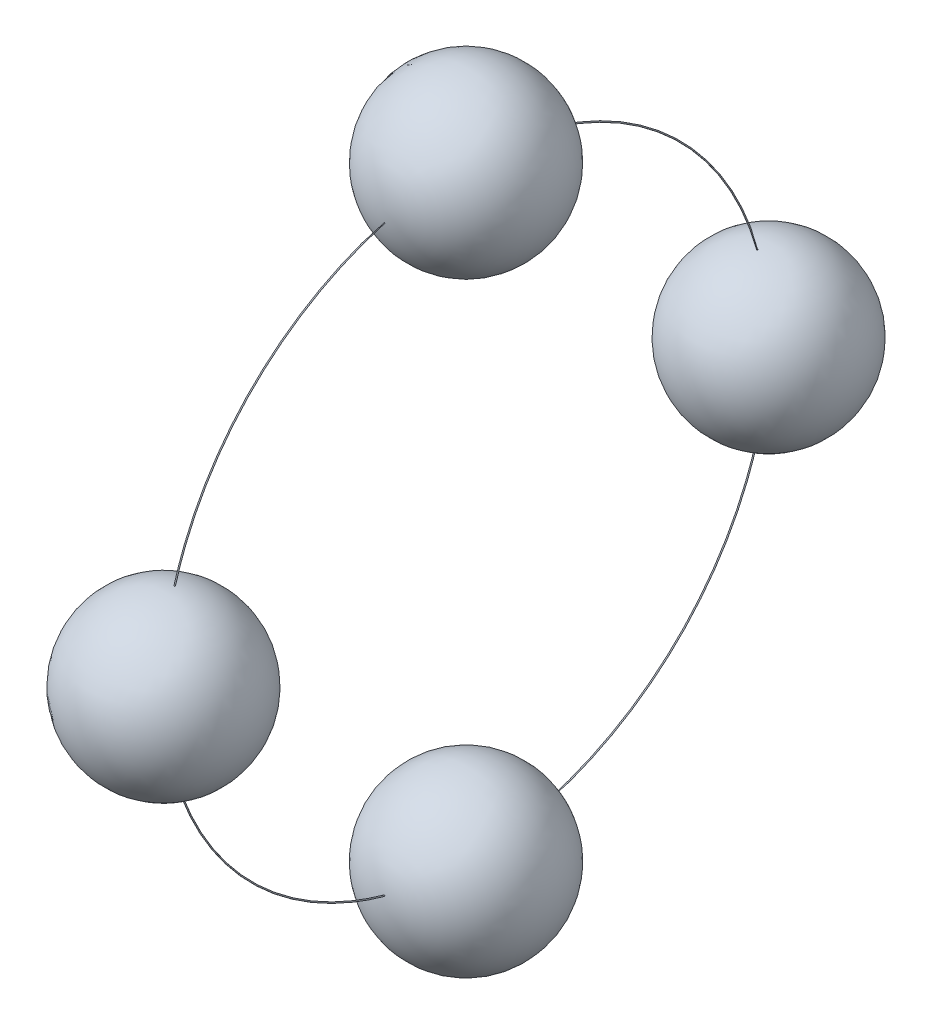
ISO-10303-21;
HEADER;
FILE_DESCRIPTION(('STEP AP214'),'2;1');
FILE_NAME('part.step','',(''),(''),'','','');
FILE_SCHEMA(('AUTOMOTIVE_DESIGN { 1 0 10303 214 1 1 1 1 }'));
ENDSEC;
DATA;
#1=APPLICATION_CONTEXT('core data for automotive mechanical design processes');
#2=APPLICATION_PROTOCOL_DEFINITION('international standard','automotive_design',2000,#1);
#3=PRODUCT_CONTEXT('',#1,'mechanical');
#4=PRODUCT('Part','Part','',(#3));
#5=PRODUCT_RELATED_PRODUCT_CATEGORY('part','',(#4));
#6=PRODUCT_DEFINITION_FORMATION('','',#4);
#7=PRODUCT_DEFINITION_CONTEXT('part definition',#1,'design');
#8=PRODUCT_DEFINITION('design','',#6,#7);
#9=PRODUCT_DEFINITION_SHAPE('','',#8);
#10=(LENGTH_UNIT() NAMED_UNIT(*) SI_UNIT(.MILLI.,.METRE.));
#11=(NAMED_UNIT(*) PLANE_ANGLE_UNIT() SI_UNIT($,.RADIAN.));
#12=(NAMED_UNIT(*) SI_UNIT($,.STERADIAN.) SOLID_ANGLE_UNIT());
#13=UNCERTAINTY_MEASURE_WITH_UNIT(LENGTH_MEASURE(1.E-05),#10,'distance_accuracy_value','');
#14=(GEOMETRIC_REPRESENTATION_CONTEXT(3) GLOBAL_UNCERTAINTY_ASSIGNED_CONTEXT((#13)) GLOBAL_UNIT_ASSIGNED_CONTEXT((#10,
#11,#12)) REPRESENTATION_CONTEXT('',''));
#15=CARTESIAN_POINT('',(0.,0.,0.));
#16=DIRECTION('',(0.,0.,1.));
#17=DIRECTION('',(1.,0.,0.));
#18=AXIS2_PLACEMENT_3D('',#15,#16,#17);
#19=CARTESIAN_POINT('',(5.,0.,0.));
#20=DIRECTION('',(1.,0.,0.));
#21=DIRECTION('',(0.,-1.,0.));
#22=AXIS2_PLACEMENT_3D('',#19,#20,#21);
#23=TOROIDAL_SURFACE('',#22,11.,0.02);
#24=CARTESIAN_POINT('',(4.98866699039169,-2.97417919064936,-10.6074064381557));
#25=CARTESIAN_POINT('',(4.98773797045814,-2.97409130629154,-10.6067674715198));
#26=CARTESIAN_POINT('',(4.98686309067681,-2.97399258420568,-10.606049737));
#27=CARTESIAN_POINT('',(4.98524699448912,-2.97377638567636,-10.6044780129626));
#28=CARTESIAN_POINT('',(4.98450595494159,-2.97365888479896,-10.6036238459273));
#29=CARTESIAN_POINT('',(4.98317937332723,-2.9734087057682,-10.6018053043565));
#30=CARTESIAN_POINT('',(4.98259369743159,-2.97327604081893,-10.6008410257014));
#31=CARTESIAN_POINT('',(4.98159303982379,-2.9729992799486,-10.5988295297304));
#32=CARTESIAN_POINT('',(4.98117801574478,-2.97285518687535,-10.5977823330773));
#33=CARTESIAN_POINT('',(4.98052730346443,-2.97255861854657,-10.5956271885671));
#34=CARTESIAN_POINT('',(4.98029279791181,-2.97240609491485,-10.5945188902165));
#35=CARTESIAN_POINT('',(4.98001383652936,-2.97209781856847,-10.5922790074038));
#36=CARTESIAN_POINT('',(4.97996939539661,-2.97194206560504,-10.5911474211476));
#37=CARTESIAN_POINT('',(4.98007204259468,-2.97163089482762,-10.5888868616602));
#38=CARTESIAN_POINT('',(4.98022013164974,-2.97147548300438,-10.5877579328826));
#39=CARTESIAN_POINT('',(4.98070561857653,-2.97117023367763,-10.5855407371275));
#40=CARTESIAN_POINT('',(4.98104301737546,-2.97102039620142,-10.5844524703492));
#41=CARTESIAN_POINT('',(4.98189776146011,-2.97073067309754,-10.5823483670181));
#42=CARTESIAN_POINT('',(4.98241500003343,-2.97059078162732,-10.581332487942));
#43=CARTESIAN_POINT('',(4.98361532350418,-2.97032491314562,-10.5794018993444));
#44=CARTESIAN_POINT('',(4.9842984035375,-2.9701989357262,-10.5784871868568));
#45=CARTESIAN_POINT('',(4.9858066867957,-2.96996533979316,-10.5767911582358));
#46=CARTESIAN_POINT('',(4.98663098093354,-2.96985761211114,-10.5760090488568));
#47=CARTESIAN_POINT('',(4.9884014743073,-2.96966277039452,-10.5745945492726));
#48=CARTESIAN_POINT('',(4.98934766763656,-2.96957565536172,-10.5739621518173));
#49=CARTESIAN_POINT('',(4.99132587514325,-2.9694253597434,-10.5728711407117));
#50=CARTESIAN_POINT('',(4.99235703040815,-2.96936196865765,-10.5724109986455));
#51=CARTESIAN_POINT('',(4.9944830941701,-2.96925992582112,-10.5716703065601));
#52=CARTESIAN_POINT('',(4.99557799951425,-2.96922127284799,-10.5713897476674));
#53=CARTESIAN_POINT('',(4.99779116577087,-2.96917008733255,-10.571018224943));
#54=CARTESIAN_POINT('',(4.9989091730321,-2.9691573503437,-10.5709257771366));
#55=CARTESIAN_POINT('',(5.00114491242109,-2.9691577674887,-10.5709288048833));
#56=CARTESIAN_POINT('',(5.00226264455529,-2.96917092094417,-10.5710242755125));
#57=CARTESIAN_POINT('',(5.00446233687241,-2.96922263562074,-10.5713996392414));
#58=CARTESIAN_POINT('',(5.00554440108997,-2.9692611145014,-10.5716789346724));
#59=CARTESIAN_POINT('',(5.00764603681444,-2.96936224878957,-10.572413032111));
#60=CARTESIAN_POINT('',(5.00866560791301,-2.96942490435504,-10.5728678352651));
#61=CARTESIAN_POINT('',(5.01061660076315,-2.96957275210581,-10.5739410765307));
#62=CARTESIAN_POINT('',(5.01154776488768,-2.96965800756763,-10.5745599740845));
#63=CARTESIAN_POINT('',(5.01329300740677,-2.96984848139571,-10.5759427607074));
#64=CARTESIAN_POINT('',(5.0141070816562,-2.9699537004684,-10.5767066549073));
#65=CARTESIAN_POINT('',(5.01560177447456,-2.97018195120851,-10.5783638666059));
#66=CARTESIAN_POINT('',(5.01628132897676,-2.9703051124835,-10.5792581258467));
#67=CARTESIAN_POINT('',(5.01748085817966,-2.97056511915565,-10.5811461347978));
#68=CARTESIAN_POINT('',(5.01800082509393,-2.97070196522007,-10.5821398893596));
#69=CARTESIAN_POINT('',(5.01887132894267,-2.9709867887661,-10.5842083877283));
#70=CARTESIAN_POINT('',(5.01922028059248,-2.97113485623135,-10.58528378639));
#71=CARTESIAN_POINT('',(5.01973234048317,-2.97143683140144,-10.5874771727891));
#72=CARTESIAN_POINT('',(5.01989544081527,-2.97159073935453,-10.5885951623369));
#73=CARTESIAN_POINT('',(5.02003192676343,-2.97190111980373,-10.5908499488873));
#74=CARTESIAN_POINT('',(5.02000404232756,-2.97205760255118,-10.5919868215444));
#75=CARTESIAN_POINT('',(5.01975629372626,-2.9723676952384,-10.5942398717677));
#76=CARTESIAN_POINT('',(5.01953642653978,-2.97252130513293,-10.5953560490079));
#77=CARTESIAN_POINT('',(5.01891018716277,-2.97282148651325,-10.597537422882));
#78=CARTESIAN_POINT('',(5.01850357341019,-2.97296804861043,-10.5986025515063));
#79=CARTESIAN_POINT('',(5.0175147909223,-2.97324970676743,-10.6006496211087));
#80=CARTESIAN_POINT('',(5.0169326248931,-2.97338480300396,-10.6016315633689));
#81=CARTESIAN_POINT('',(5.0156118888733,-2.97363899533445,-10.6034792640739));
#82=CARTESIAN_POINT('',(5.01487406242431,-2.97375816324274,-10.6043455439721));
#83=CARTESIAN_POINT('',(5.01326092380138,-2.97397773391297,-10.6059417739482));
#84=CARTESIAN_POINT('',(5.01238561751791,-2.97407813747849,-10.606671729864));
#85=CARTESIAN_POINT('',(5.01053036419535,-2.9742564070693,-10.6079678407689));
#86=CARTESIAN_POINT('',(5.0095513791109,-2.97433445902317,-10.608535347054));
#87=CARTESIAN_POINT('',(5.00751053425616,-2.97446682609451,-10.6094977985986));
#88=CARTESIAN_POINT('',(5.00644868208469,-2.97452114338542,-10.6098927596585));
#89=CARTESIAN_POINT('',(5.00428227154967,-2.974604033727,-10.6104954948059));
#90=CARTESIAN_POINT('',(5.00317817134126,-2.9746328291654,-10.6107048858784));
#91=CARTESIAN_POINT('',(5.0009498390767,-2.97466462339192,-10.6109360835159));
#92=CARTESIAN_POINT('',(4.99982560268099,-2.97466761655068,-10.6109578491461));
#93=CARTESIAN_POINT('',(4.99759467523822,-2.97464775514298,-10.6108134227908));
#94=CARTESIAN_POINT('',(4.99648792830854,-2.97462501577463,-10.6106480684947));
#95=CARTESIAN_POINT('',(4.99431912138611,-2.97455456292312,-10.6101357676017));
#96=CARTESIAN_POINT('',(4.99325700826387,-2.97450688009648,-10.6097890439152));
#97=CARTESIAN_POINT('',(4.99160640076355,-2.97441121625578,-10.6090934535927));
#98=CARTESIAN_POINT('',(4.9909944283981,-2.97437057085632,-10.608797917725));
#99=CARTESIAN_POINT('',(4.98980410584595,-2.97428098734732,-10.6081465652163));
#100=CARTESIAN_POINT('',(4.98922575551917,-2.97423204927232,-10.6077907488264));
#101=CARTESIAN_POINT('',(4.98866699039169,-2.97417919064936,-10.6074064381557));
#102=B_SPLINE_CURVE_WITH_KNOTS('',3,(#24,#25,#26,#27,#28,#29,#30,#31,#32,#33,#34,#35,#36,#37,
#38,#39,#40,#41,#42,#43,#44,#45,#46,#47,#48,#49,#50,#51,#52,#53,#54,#55,#56,#57,#58,#59,#60,#61,
#62,#63,#64,#65,#66,#67,#68,#69,#70,#71,#72,#73,#74,#75,#76,#77,#78,#79,#80,#81,#82,#83,#84,#85,
#86,#87,#88,#89,#90,#91,#92,#93,#94,#95,#96,#97,#98,#99,#100,#101),.UNSPECIFIED.,.T.,.F.,(4,2,2,
2,2,2,2,2,2,2,2,2,2,2,2,2,2,2,2,2,2,2,2,2,2,2,2,2,2,2,2,2,2,2,2,2,2,2,4),(0.,
0.00339038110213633,0.00678521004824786,0.0101771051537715,0.0135681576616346,
0.0169812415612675,0.0203945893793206,0.0238257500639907,0.0272569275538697,0.0306860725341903,
0.0341151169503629,0.037522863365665,0.0409304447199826,0.0443070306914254,0.04768344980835,
0.0510331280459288,0.0543827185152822,0.0577214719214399,0.0610602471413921,0.064408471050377,
0.0677568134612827,0.0711306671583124,0.0745046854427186,0.0779094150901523,0.0813142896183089,
0.0847418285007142,0.0881694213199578,0.091601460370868,0.0950334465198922,0.0984493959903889,
0.101865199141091,0.105251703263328,0.108637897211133,0.111994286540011,0.115351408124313,
0.118693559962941,0.122031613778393,0.124070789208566,0.126109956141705),.UNSPECIFIED.);
#103=CARTESIAN_POINT('',(4.98866699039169,-2.97417919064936,-10.6074064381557));
#104=VERTEX_POINT('',#103);
#105=EDGE_CURVE('E10',#104,#104,#102,.T.);
#106=ORIENTED_EDGE('',*,*,#105,.F.);
#107=EDGE_LOOP('',(#106));
#108=FACE_BOUND('',#107,.T.);
#109=CARTESIAN_POINT('',(4.98866699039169,-10.6074064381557,-2.97417919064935));
#110=CARTESIAN_POINT('',(4.98958468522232,-10.6080374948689,-2.97426598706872));
#111=CARTESIAN_POINT('',(4.99055652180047,-10.6085926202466,-2.97434233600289));
#112=CARTESIAN_POINT('',(4.99258117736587,-10.6095339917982,-2.97447180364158));
#113=CARTESIAN_POINT('',(4.99363408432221,-10.6099200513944,-2.97452489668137));
#114=CARTESIAN_POINT('',(4.99579032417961,-10.6105111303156,-2.97460618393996));
#115=CARTESIAN_POINT('',(4.99689364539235,-10.6107161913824,-2.9746343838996));
#116=CARTESIAN_POINT('',(4.99911911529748,-10.6109391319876,-2.97466504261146));
#117=CARTESIAN_POINT('',(5.00024125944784,-10.61095705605,-2.97466750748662));
#118=CARTESIAN_POINT('',(5.00246892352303,-10.6108055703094,-2.97464667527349));
#119=CARTESIAN_POINT('',(5.00357448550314,-10.6106367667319,-2.97462346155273));
#120=CARTESIAN_POINT('',(5.00574137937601,-10.6101178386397,-2.97455209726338));
#121=CARTESIAN_POINT('',(5.00680270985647,-10.6097677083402,-2.9745039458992));
#122=CARTESIAN_POINT('',(5.0088522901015,-10.6088960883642,-2.97438407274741));
#123=CARTESIAN_POINT('',(5.009840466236,-10.6083744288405,-2.97431232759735));
#124=CARTESIAN_POINT('',(5.01171513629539,-10.6071751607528,-2.97414738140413));
#125=CARTESIAN_POINT('',(5.01260162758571,-10.6064975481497,-2.97405417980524));
#126=CARTESIAN_POINT('',(5.01425401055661,-10.6050011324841,-2.97384834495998));
#127=CARTESIAN_POINT('',(5.01501909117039,-10.6041814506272,-2.97373559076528));
#128=CARTESIAN_POINT('',(5.01640098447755,-10.6024274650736,-2.97349429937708));
#129=CARTESIAN_POINT('',(5.01701779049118,-10.6014931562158,-2.97336576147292));
#130=CARTESIAN_POINT('',(5.01809153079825,-10.599527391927,-2.97309530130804));
#131=CARTESIAN_POINT('',(5.01854696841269,-10.5984951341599,-2.97295326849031));
#132=CARTESIAN_POINT('',(5.01927798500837,-10.596369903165,-2.97266082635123));
#133=CARTESIAN_POINT('',(5.01955355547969,-10.5952769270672,-2.97251041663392));
#134=CARTESIAN_POINT('',(5.01991897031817,-10.5930521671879,-2.97220423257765));
#135=CARTESIAN_POINT('',(5.02000735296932,-10.5919201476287,-2.9720484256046));
#136=CARTESIAN_POINT('',(5.01999168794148,-10.5896574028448,-2.97173696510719));
#137=CARTESIAN_POINT('',(5.01988763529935,-10.5885266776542,-2.9715813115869));
#138=CARTESIAN_POINT('',(5.01948923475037,-10.5862949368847,-2.97127407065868));
#139=CARTESIAN_POINT('',(5.01919429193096,-10.5851940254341,-2.97112249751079));
#140=CARTESIAN_POINT('',(5.01842148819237,-10.5830570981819,-2.97082826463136));
#141=CARTESIAN_POINT('',(5.01794362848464,-10.5820210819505,-2.97068560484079));
#142=CARTESIAN_POINT('',(5.01681969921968,-10.5800468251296,-2.97041373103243));
#143=CARTESIAN_POINT('',(5.01617412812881,-10.5791083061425,-2.97028447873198));
#144=CARTESIAN_POINT('',(5.01473194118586,-10.5773530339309,-2.97004272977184));
#145=CARTESIAN_POINT('',(5.01393533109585,-10.5765362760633,-2.96993023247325));
#146=CARTESIAN_POINT('',(5.01222018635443,-10.5750546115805,-2.96972614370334));
#147=CARTESIAN_POINT('',(5.01130264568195,-10.5743885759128,-2.96963439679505));
#148=CARTESIAN_POINT('',(5.00936686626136,-10.5732202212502,-2.96947344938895));
#149=CARTESIAN_POINT('',(5.00834863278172,-10.5727178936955,-2.96940424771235));
#150=CARTESIAN_POINT('',(5.00625037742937,-10.5718959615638,-2.96929101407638));
#151=CARTESIAN_POINT('',(5.00517100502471,-10.5715747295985,-2.96924675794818));
#152=CARTESIAN_POINT('',(5.00297298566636,-10.5711176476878,-2.96918378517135));
#153=CARTESIAN_POINT('',(5.00185434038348,-10.5709817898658,-2.96916506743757));
#154=CARTESIAN_POINT('',(4.99961722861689,-10.5708998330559,-2.96915377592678));
#155=CARTESIAN_POINT('',(4.99849880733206,-10.5709525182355,-2.96916103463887));
#156=CARTESIAN_POINT('',(4.99628683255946,-10.571243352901,-2.96920110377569));
#157=CARTESIAN_POINT('',(4.99519327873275,-10.5714814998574,-2.96923391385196));
#158=CARTESIAN_POINT('',(4.99306299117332,-10.5721358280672,-2.96932405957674));
#159=CARTESIAN_POINT('',(4.99202620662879,-10.572551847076,-2.96938137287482));
#160=CARTESIAN_POINT('',(4.99003737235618,-10.5735495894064,-2.96951882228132));
#161=CARTESIAN_POINT('',(4.98908532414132,-10.5741313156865,-2.9695989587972));
#162=CARTESIAN_POINT('',(4.98728774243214,-10.5754467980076,-2.96978016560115));
#163=CARTESIAN_POINT('',(4.9864427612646,-10.5761812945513,-2.96988133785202));
#164=CARTESIAN_POINT('',(4.98488794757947,-10.5777793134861,-2.97010144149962));
#165=CARTESIAN_POINT('',(4.98417812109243,-10.5786428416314,-2.97022037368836));
#166=CARTESIAN_POINT('',(4.9829071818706,-10.580482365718,-2.97047371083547));
#167=CARTESIAN_POINT('',(4.98234740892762,-10.5814592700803,-2.97060824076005));
#168=CARTESIAN_POINT('',(4.98139972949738,-10.5834917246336,-2.97088811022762));
#169=CARTESIAN_POINT('',(4.98101183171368,-10.5845472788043,-2.97103345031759));
#170=CARTESIAN_POINT('',(4.9804156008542,-10.5867168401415,-2.97133215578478));
#171=CARTESIAN_POINT('',(4.98020884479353,-10.5878312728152,-2.97148557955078));
#172=CARTESIAN_POINT('',(4.9799861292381,-10.5900786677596,-2.97179495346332));
#173=CARTESIAN_POINT('',(4.97997016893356,-10.5912116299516,-2.97195090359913));
#174=CARTESIAN_POINT('',(4.98012983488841,-10.5934696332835,-2.97226168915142));
#175=CARTESIAN_POINT('',(4.98030636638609,-10.5945946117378,-2.97241651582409));
#176=CARTESIAN_POINT('',(4.9808478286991,-10.59679950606,-2.97271994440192));
#177=CARTESIAN_POINT('',(4.98121280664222,-10.5978794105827,-2.9728685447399));
#178=CARTESIAN_POINT('',(4.98212092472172,-10.5999621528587,-2.97315512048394));
#179=CARTESIAN_POINT('',(4.98266395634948,-10.6009650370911,-2.97329310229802));
#180=CARTESIAN_POINT('',(4.9839130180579,-10.6028645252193,-2.97355442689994));
#181=CARTESIAN_POINT('',(4.98461884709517,-10.6037612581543,-2.97367778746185));
#182=CARTESIAN_POINT('',(4.98588772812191,-10.6051175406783,-2.97386435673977));
#183=CARTESIAN_POINT('',(4.98640822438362,-10.6056168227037,-2.97393303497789));
#184=CARTESIAN_POINT('',(4.98750056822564,-10.6065568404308,-2.97406233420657));
#185=CARTESIAN_POINT('',(4.98807241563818,-10.6069975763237,-2.97412295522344));
#186=CARTESIAN_POINT('',(4.98866699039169,-10.6074064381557,-2.97417919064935));
#187=B_SPLINE_CURVE_WITH_KNOTS('',3,(#109,#110,#111,#112,#113,#114,#115,#116,#117,#118,#119,
#120,#121,#122,#123,#124,#125,#126,#127,#128,#129,#130,#131,#132,#133,#134,#135,#136,#137,#138,
#139,#140,#141,#142,#143,#144,#145,#146,#147,#148,#149,#150,#151,#152,#153,#154,#155,#156,#157,
#158,#159,#160,#161,#162,#163,#164,#165,#166,#167,#168,#169,#170,#171,#172,#173,#174,#175,#176,
#177,#178,#179,#180,#181,#182,#183,#184,#185,#186),.UNSPECIFIED.,.T.,.F.,(4,2,2,2,2,2,2,2,2,2,2,
2,2,2,2,2,2,2,2,2,2,2,2,2,2,2,2,2,2,2,2,2,2,2,2,2,2,2,4),(0.,0.00334870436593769,
0.00670109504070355,0.0100527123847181,0.0134035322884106,0.016743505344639,0.0200835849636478,
0.0234269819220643,0.0267704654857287,0.0301354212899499,0.0335005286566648,0.0368960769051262,
0.0402917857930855,0.0437139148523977,0.0471361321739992,0.0505690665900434,0.0540019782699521,
0.0574248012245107,0.0608474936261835,0.0642436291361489,0.0676395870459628,0.0710045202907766,
0.0743693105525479,0.077712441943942,0.0810555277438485,0.0843955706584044,0.0877356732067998,
0.091092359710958,0.0944491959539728,0.0978350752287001,0.101221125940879,0.104636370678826,
0.108051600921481,0.111482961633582,0.11491518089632,0.118345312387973,0.121771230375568,
0.12394086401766,0.126110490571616),.UNSPECIFIED.);
#188=CARTESIAN_POINT('',(4.98866699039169,-10.6074064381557,-2.97417919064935));
#189=VERTEX_POINT('',#188);
#190=EDGE_CURVE('E35',#189,#189,#187,.T.);
#191=ORIENTED_EDGE('',*,*,#190,.F.);
#192=EDGE_LOOP('',(#191));
#193=FACE_BOUND('',#192,.T.);
#194=ADVANCED_FACE('F14',(#108,#193),#23,.T.);
#195=CARTESIAN_POINT('',(4.98866699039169,2.97417919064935,-10.6074064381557));
#196=CARTESIAN_POINT('',(4.98958468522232,2.97426598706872,-10.6080374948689));
#197=CARTESIAN_POINT('',(4.99055652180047,2.97434233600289,-10.6085926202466));
#198=CARTESIAN_POINT('',(4.99258117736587,2.97447180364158,-10.6095339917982));
#199=CARTESIAN_POINT('',(4.99363408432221,2.97452489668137,-10.6099200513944));
#200=CARTESIAN_POINT('',(4.99579032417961,2.97460618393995,-10.6105111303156));
#201=CARTESIAN_POINT('',(4.99689364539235,2.9746343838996,-10.6107161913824));
#202=CARTESIAN_POINT('',(4.99911911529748,2.97466504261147,-10.6109391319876));
#203=CARTESIAN_POINT('',(5.00024125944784,2.97466750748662,-10.6109570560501));
#204=CARTESIAN_POINT('',(5.00246892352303,2.97464667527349,-10.6108055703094));
#205=CARTESIAN_POINT('',(5.00357448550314,2.97462346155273,-10.6106367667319));
#206=CARTESIAN_POINT('',(5.00574137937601,2.97455209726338,-10.6101178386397));
#207=CARTESIAN_POINT('',(5.00680270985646,2.9745039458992,-10.6097677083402));
#208=CARTESIAN_POINT('',(5.00885229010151,2.97438407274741,-10.6088960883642));
#209=CARTESIAN_POINT('',(5.009840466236,2.97431232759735,-10.6083744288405));
#210=CARTESIAN_POINT('',(5.01171513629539,2.97414738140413,-10.6071751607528));
#211=CARTESIAN_POINT('',(5.01260162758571,2.97405417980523,-10.6064975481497));
#212=CARTESIAN_POINT('',(5.01425401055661,2.97384834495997,-10.6050011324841));
#213=CARTESIAN_POINT('',(5.01501909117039,2.97373559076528,-10.6041814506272));
#214=CARTESIAN_POINT('',(5.01640098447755,2.97349429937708,-10.6024274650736));
#215=CARTESIAN_POINT('',(5.01701779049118,2.97336576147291,-10.6014931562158));
#216=CARTESIAN_POINT('',(5.01809153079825,2.97309530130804,-10.599527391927));
#217=CARTESIAN_POINT('',(5.01854696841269,2.97295326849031,-10.5984951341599));
#218=CARTESIAN_POINT('',(5.01927798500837,2.97266082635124,-10.596369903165));
#219=CARTESIAN_POINT('',(5.01955355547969,2.97251041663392,-10.5952769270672));
#220=CARTESIAN_POINT('',(5.01991897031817,2.97220423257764,-10.5930521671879));
#221=CARTESIAN_POINT('',(5.02000735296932,2.9720484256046,-10.5919201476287));
#222=CARTESIAN_POINT('',(5.01999168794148,2.97173696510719,-10.5896574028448));
#223=CARTESIAN_POINT('',(5.01988763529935,2.9715813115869,-10.5885266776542));
#224=CARTESIAN_POINT('',(5.01948923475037,2.97127407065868,-10.5862949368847));
#225=CARTESIAN_POINT('',(5.01919429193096,2.97112249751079,-10.5851940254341));
#226=CARTESIAN_POINT('',(5.01842148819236,2.97082826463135,-10.5830570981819));
#227=CARTESIAN_POINT('',(5.01794362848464,2.97068560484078,-10.5820210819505));
#228=CARTESIAN_POINT('',(5.01681969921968,2.97041373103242,-10.5800468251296));
#229=CARTESIAN_POINT('',(5.01617412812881,2.97028447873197,-10.5791083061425));
#230=CARTESIAN_POINT('',(5.01473194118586,2.97004272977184,-10.5773530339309));
#231=CARTESIAN_POINT('',(5.01393533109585,2.96993023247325,-10.5765362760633));
#232=CARTESIAN_POINT('',(5.01222018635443,2.96972614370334,-10.5750546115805));
#233=CARTESIAN_POINT('',(5.01130264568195,2.96963439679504,-10.5743885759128));
#234=CARTESIAN_POINT('',(5.00936686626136,2.96947344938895,-10.5732202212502));
#235=CARTESIAN_POINT('',(5.00834863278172,2.96940424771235,-10.5727178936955));
#236=CARTESIAN_POINT('',(5.00625037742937,2.96929101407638,-10.5718959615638));
#237=CARTESIAN_POINT('',(5.0051710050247,2.96924675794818,-10.5715747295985));
#238=CARTESIAN_POINT('',(5.00297298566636,2.96918378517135,-10.5711176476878));
#239=CARTESIAN_POINT('',(5.00185434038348,2.96916506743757,-10.5709817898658));
#240=CARTESIAN_POINT('',(4.99961722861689,2.96915377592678,-10.5708998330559));
#241=CARTESIAN_POINT('',(4.99849880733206,2.96916103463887,-10.5709525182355));
#242=CARTESIAN_POINT('',(4.99628683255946,2.96920110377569,-10.571243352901));
#243=CARTESIAN_POINT('',(4.99519327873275,2.96923391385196,-10.5714814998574));
#244=CARTESIAN_POINT('',(4.99306299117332,2.96932405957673,-10.5721358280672));
#245=CARTESIAN_POINT('',(4.99202620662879,2.96938137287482,-10.572551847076));
#246=CARTESIAN_POINT('',(4.99003737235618,2.96951882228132,-10.5735495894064));
#247=CARTESIAN_POINT('',(4.98908532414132,2.9695989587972,-10.5741313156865));
#248=CARTESIAN_POINT('',(4.98728774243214,2.96978016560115,-10.5754467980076));
#249=CARTESIAN_POINT('',(4.9864427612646,2.96988133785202,-10.5761812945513));
#250=CARTESIAN_POINT('',(4.98488794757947,2.97010144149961,-10.5777793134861));
#251=CARTESIAN_POINT('',(4.98417812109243,2.97022037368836,-10.5786428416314));
#252=CARTESIAN_POINT('',(4.9829071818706,2.97047371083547,-10.580482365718));
#253=CARTESIAN_POINT('',(4.98234740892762,2.97060824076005,-10.5814592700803));
#254=CARTESIAN_POINT('',(4.98139972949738,2.97088811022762,-10.5834917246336));
#255=CARTESIAN_POINT('',(4.98101183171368,2.97103345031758,-10.5845472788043));
#256=CARTESIAN_POINT('',(4.9804156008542,2.97133215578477,-10.5867168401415));
#257=CARTESIAN_POINT('',(4.98020884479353,2.97148557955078,-10.5878312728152));
#258=CARTESIAN_POINT('',(4.9799861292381,2.97179495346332,-10.5900786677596));
#259=CARTESIAN_POINT('',(4.97997016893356,2.97195090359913,-10.5912116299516));
#260=CARTESIAN_POINT('',(4.98012983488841,2.97226168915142,-10.5934696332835));
#261=CARTESIAN_POINT('',(4.98030636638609,2.97241651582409,-10.5945946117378));
#262=CARTESIAN_POINT('',(4.9808478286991,2.97271994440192,-10.59679950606));
#263=CARTESIAN_POINT('',(4.98121280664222,2.9728685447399,-10.5978794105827));
#264=CARTESIAN_POINT('',(4.98212092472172,2.97315512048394,-10.5999621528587));
#265=CARTESIAN_POINT('',(4.98266395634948,2.97329310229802,-10.6009650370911));
#266=CARTESIAN_POINT('',(4.9839130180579,2.97355442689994,-10.6028645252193));
#267=CARTESIAN_POINT('',(4.98461884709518,2.97367778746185,-10.6037612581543));
#268=CARTESIAN_POINT('',(4.98588772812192,2.97386435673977,-10.6051175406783));
#269=CARTESIAN_POINT('',(4.98640822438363,2.97393303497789,-10.6056168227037));
#270=CARTESIAN_POINT('',(4.98750056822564,2.97406233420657,-10.6065568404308));
#271=CARTESIAN_POINT('',(4.98807241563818,2.97412295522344,-10.6069975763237));
#272=CARTESIAN_POINT('',(4.98866699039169,2.97417919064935,-10.6074064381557));
#273=B_SPLINE_CURVE_WITH_KNOTS('',3,(#195,#196,#197,#198,#199,#200,#201,#202,#203,#204,#205,
#206,#207,#208,#209,#210,#211,#212,#213,#214,#215,#216,#217,#218,#219,#220,#221,#222,#223,#224,
#225,#226,#227,#228,#229,#230,#231,#232,#233,#234,#235,#236,#237,#238,#239,#240,#241,#242,#243,
#244,#245,#246,#247,#248,#249,#250,#251,#252,#253,#254,#255,#256,#257,#258,#259,#260,#261,#262,
#263,#264,#265,#266,#267,#268,#269,#270,#271,#272),.UNSPECIFIED.,.T.,.F.,(4,2,2,2,2,2,2,2,2,2,2,
2,2,2,2,2,2,2,2,2,2,2,2,2,2,2,2,2,2,2,2,2,2,2,2,2,2,2,4),(0.,0.00334870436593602,
0.00670109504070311,0.0100527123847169,0.0134035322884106,0.0167435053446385,0.0200835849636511,
0.0234269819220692,0.0267704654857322,0.0301354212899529,0.0335005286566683,0.0368960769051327,
0.0402917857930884,0.0437139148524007,0.0471361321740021,0.0505690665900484,0.0540019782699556,
0.0574248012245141,0.0608474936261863,0.0642436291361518,0.0676395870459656,0.0710045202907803,
0.0743693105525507,0.0777124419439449,0.0810555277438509,0.0843955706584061,0.0877356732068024,
0.0910923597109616,0.0944491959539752,0.0978350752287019,0.101221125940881,0.104636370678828,
0.108051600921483,0.111482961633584,0.114915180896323,0.118345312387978,0.121771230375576,
0.123940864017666,0.126110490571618),.UNSPECIFIED.);
#274=CARTESIAN_POINT('',(4.98866699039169,2.97417919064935,-10.6074064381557));
#275=VERTEX_POINT('',#274);
#276=EDGE_CURVE('E26',#275,#275,#273,.T.);
#277=ORIENTED_EDGE('',*,*,#276,.F.);
#278=EDGE_LOOP('',(#277));
#279=FACE_BOUND('',#278,.T.);
#280=CARTESIAN_POINT('',(4.98974884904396,10.5737542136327,-2.96954700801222));
#281=CARTESIAN_POINT('',(4.99070471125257,10.5731836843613,-2.96946841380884));
#282=CARTESIAN_POINT('',(4.99170964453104,10.5726923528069,-2.96940072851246));
#283=CARTESIAN_POINT('',(4.99378927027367,10.5718832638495,-2.96928926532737));
#284=CARTESIAN_POINT('',(4.99486403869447,10.571565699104,-2.96924551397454));
#285=CARTESIAN_POINT('',(4.99705200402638,10.5711142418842,-2.96918331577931));
#286=CARTESIAN_POINT('',(4.99816519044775,10.5709802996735,-2.96916486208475));
#287=CARTESIAN_POINT('',(5.00039815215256,10.5709000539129,-2.96915380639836));
#288=CARTESIAN_POINT('',(5.00151792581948,10.5709537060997,-2.9691611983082));
#289=CARTESIAN_POINT('',(5.00372961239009,10.5712465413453,-2.96920154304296));
#290=CARTESIAN_POINT('',(5.00482158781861,10.5714852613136,-2.96923443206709));
#291=CARTESIAN_POINT('',(5.00694974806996,10.5721405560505,-2.96932471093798));
#292=CARTESIAN_POINT('',(5.00798593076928,10.5725571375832,-2.96938210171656));
#293=CARTESIAN_POINT('',(5.00997563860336,10.5735569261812,-2.96951983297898));
#294=CARTESIAN_POINT('',(5.01092898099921,10.574140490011,-2.96960022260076));
#295=CARTESIAN_POINT('',(5.01272415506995,10.5754568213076,-2.96978154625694));
#296=CARTESIAN_POINT('',(5.0135659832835,10.5761895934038,-2.9698824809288));
#297=CARTESIAN_POINT('',(5.0151208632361,10.5777890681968,-2.97010278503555));
#298=CARTESIAN_POINT('',(5.01583294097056,10.5786566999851,-2.97022228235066));
#299=CARTESIAN_POINT('',(5.01710153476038,10.5804971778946,-2.97047575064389));
#300=CARTESIAN_POINT('',(5.01765804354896,10.5814700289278,-2.97060972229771));
#301=CARTESIAN_POINT('',(5.01860502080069,10.5835028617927,-2.97088964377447));
#302=CARTESIAN_POINT('',(5.01899392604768,10.5845635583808,-2.97103569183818));
#303=CARTESIAN_POINT('',(5.01958789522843,10.5867343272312,-2.97133456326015));
#304=CARTESIAN_POINT('',(5.01979295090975,10.5878444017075,-2.97148738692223));
#305=CARTESIAN_POINT('',(5.02001457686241,10.5900908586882,-2.97179663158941));
#306=CARTESIAN_POINT('',(5.02002979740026,10.5912273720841,-2.97195307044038));
#307=CARTESIAN_POINT('',(5.01986784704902,10.5934868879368,-2.97226406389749));
#308=CARTESIAN_POINT('',(5.01969067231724,10.5946098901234,-2.97241861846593));
#309=CARTESIAN_POINT('',(5.01914811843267,10.5968127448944,-2.9727217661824));
#310=CARTESIAN_POINT('',(5.01878236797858,10.5978925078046,-2.97287034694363));
#311=CARTESIAN_POINT('',(5.01787234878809,10.5999755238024,-2.97315696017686));
#312=CARTESIAN_POINT('',(5.01732808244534,10.6009787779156,-2.97329499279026));
#313=CARTESIAN_POINT('',(5.01607853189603,10.6028757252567,-2.97355596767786));
#314=CARTESIAN_POINT('',(5.01537391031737,10.6037698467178,-2.97367896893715));
#315=CARTESIAN_POINT('',(5.01382198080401,10.6054269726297,-2.97390692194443));
#316=CARTESIAN_POINT('',(5.01297467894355,10.6061899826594,-2.97401187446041));
#317=CARTESIAN_POINT('',(5.01116893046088,10.6075563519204,-2.97419981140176));
#318=CARTESIAN_POINT('',(5.01021146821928,10.6081609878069,-2.97428297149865));
#319=CARTESIAN_POINT('',(5.00820695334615,10.6092007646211,-2.97442597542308));
#320=CARTESIAN_POINT('',(5.00715990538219,10.609635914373,-2.97448582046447));
#321=CARTESIAN_POINT('',(5.00501596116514,10.6103204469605,-2.97457996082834));
#322=CARTESIAN_POINT('',(5.00391959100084,10.6105714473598,-2.97461447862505));
#323=CARTESIAN_POINT('',(5.00169982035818,10.6108864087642,-2.97465779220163));
#324=CARTESIAN_POINT('',(5.00057642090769,10.6109503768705,-2.97466658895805));
#325=CARTESIAN_POINT('',(4.99834107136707,10.6108895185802,-2.97465821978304));
#326=CARTESIAN_POINT('',(4.99722909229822,10.610765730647,-2.97464119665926));
#327=CARTESIAN_POINT('',(4.99504190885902,10.610334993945,-2.97458196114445));
#328=CARTESIAN_POINT('',(4.99396670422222,10.6100280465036,-2.97453974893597));
#329=CARTESIAN_POINT('',(4.9918831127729,10.6092400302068,-2.97443137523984));
#330=CARTESIAN_POINT('',(4.99087474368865,10.6087589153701,-2.97436520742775));
#331=CARTESIAN_POINT('',(4.98895320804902,10.6076367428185,-2.97421086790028));
#332=CARTESIAN_POINT('',(4.98804004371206,10.6069956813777,-2.97412269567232));
#333=CARTESIAN_POINT('',(4.98632893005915,10.6055679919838,-2.97392631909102));
#334=CARTESIAN_POINT('',(4.98553168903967,10.6047805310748,-2.97381800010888));
#335=CARTESIAN_POINT('',(4.98408053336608,10.6030852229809,-2.9735847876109));
#336=CARTESIAN_POINT('',(4.9834266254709,10.6021773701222,-2.97345989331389));
#337=CARTESIAN_POINT('',(4.98227448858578,10.6002583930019,-2.97319587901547));
#338=CARTESIAN_POINT('',(4.98177770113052,10.5992464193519,-2.97305664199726));
#339=CARTESIAN_POINT('',(4.98096108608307,10.5971546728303,-2.97276881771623));
#340=CARTESIAN_POINT('',(4.98064126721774,10.5960748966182,-2.97262022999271));
#341=CARTESIAN_POINT('',(4.98018518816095,10.5938687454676,-2.97231661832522));
#342=CARTESIAN_POINT('',(4.98005044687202,10.5927420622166,-2.97216155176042));
#343=CARTESIAN_POINT('',(4.97997301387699,10.590482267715,-2.97185050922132));
#344=CARTESIAN_POINT('',(4.98003032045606,10.589349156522,-2.97169453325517));
#345=CARTESIAN_POINT('',(4.98033601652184,10.5871042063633,-2.97138548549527));
#346=CARTESIAN_POINT('',(4.98058511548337,10.5859924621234,-2.97123242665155));
#347=CARTESIAN_POINT('',(4.98126867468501,10.5838260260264,-2.97093414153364));
#348=CARTESIAN_POINT('',(4.98170318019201,10.5827713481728,-2.97078891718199));
#349=CARTESIAN_POINT('',(4.982744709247,10.5807516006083,-2.97051078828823));
#350=CARTESIAN_POINT('',(4.98335143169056,10.5797863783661,-2.97037786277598));
#351=CARTESIAN_POINT('',(4.98472059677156,10.5779724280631,-2.97012803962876));
#352=CARTESIAN_POINT('',(4.98548284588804,10.5771235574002,-2.97001112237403));
#353=CARTESIAN_POINT('',(4.9868353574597,10.5758538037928,-2.96983622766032));
#354=CARTESIAN_POINT('',(4.98738562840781,10.5753904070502,-2.969772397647));
#355=CARTESIAN_POINT('',(4.98853337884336,10.5745250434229,-2.96965319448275));
#356=CARTESIAN_POINT('',(4.98913085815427,10.5741230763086,-2.9695978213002));
#357=CARTESIAN_POINT('',(4.98974884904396,10.5737542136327,-2.96954700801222));
#358=B_SPLINE_CURVE_WITH_KNOTS('',3,(#280,#281,#282,#283,#284,#285,#286,#287,#288,#289,#290,
#291,#292,#293,#294,#295,#296,#297,#298,#299,#300,#301,#302,#303,#304,#305,#306,#307,#308,#309,
#310,#311,#312,#313,#314,#315,#316,#317,#318,#319,#320,#321,#322,#323,#324,#325,#326,#327,#328,
#329,#330,#331,#332,#333,#334,#335,#336,#337,#338,#339,#340,#341,#342,#343,#344,#345,#346,#347,
#348,#349,#350,#351,#352,#353,#354,#355,#356,#357),.UNSPECIFIED.,.T.,.F.,(4,2,2,2,2,2,2,2,2,2,2,
2,2,2,2,2,2,2,2,2,2,2,2,2,2,2,2,2,2,2,2,2,2,2,2,2,2,2,4),(0.,0.00334524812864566,
0.00669419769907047,0.0100422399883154,0.0133894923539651,0.0167283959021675,0.0200674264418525,
0.023413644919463,0.026759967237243,0.0301304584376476,0.0335011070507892,0.0369025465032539,
0.0403041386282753,0.0437299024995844,0.0471557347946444,0.0505883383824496,0.0540208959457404,
0.0574395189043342,0.0608579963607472,0.0642480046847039,0.0676378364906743,0.07099752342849,
0.0743570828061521,0.0776981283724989,0.0810391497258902,0.0843810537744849,0.0877230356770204,
0.0910846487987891,0.0944464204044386,0.0978381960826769,0.101230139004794,0.104649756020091,
0.108069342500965,0.111501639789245,0.114934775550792,0.118361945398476,0.121784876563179,
0.12394767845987,0.126110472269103),.UNSPECIFIED.);
#359=CARTESIAN_POINT('',(4.98974884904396,10.5737542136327,-2.96954700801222));
#360=VERTEX_POINT('',#359);
#361=EDGE_CURVE('E79',#360,#360,#358,.T.);
#362=ORIENTED_EDGE('',*,*,#361,.F.);
#363=EDGE_LOOP('',(#362));
#364=FACE_BOUND('',#363,.T.);
#365=ADVANCED_FACE('F102',(#279,#364),#23,.T.);
#366=CARTESIAN_POINT('',(4.98866699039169,-10.6074064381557,2.97417919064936));
#367=CARTESIAN_POINT('',(4.98773797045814,-10.6067674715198,2.97409130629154));
#368=CARTESIAN_POINT('',(4.98686309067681,-10.606049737,2.97399258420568));
#369=CARTESIAN_POINT('',(4.98524699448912,-10.6044780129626,2.97377638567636));
#370=CARTESIAN_POINT('',(4.98450595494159,-10.6036238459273,2.97365888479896));
#371=CARTESIAN_POINT('',(4.98317937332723,-10.6018053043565,2.9734087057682));
#372=CARTESIAN_POINT('',(4.98259369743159,-10.6008410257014,2.97327604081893));
#373=CARTESIAN_POINT('',(4.98159303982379,-10.5988295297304,2.9729992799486));
#374=CARTESIAN_POINT('',(4.98117801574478,-10.5977823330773,2.97285518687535));
#375=CARTESIAN_POINT('',(4.98052730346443,-10.5956271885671,2.97255861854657));
#376=CARTESIAN_POINT('',(4.98029279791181,-10.5945188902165,2.97240609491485));
#377=CARTESIAN_POINT('',(4.98001383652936,-10.5922790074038,2.97209781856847));
#378=CARTESIAN_POINT('',(4.97996939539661,-10.5911474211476,2.97194206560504));
#379=CARTESIAN_POINT('',(4.98007204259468,-10.5888868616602,2.97163089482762));
#380=CARTESIAN_POINT('',(4.98022013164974,-10.5877579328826,2.97147548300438));
#381=CARTESIAN_POINT('',(4.98070561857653,-10.5855407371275,2.97117023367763));
#382=CARTESIAN_POINT('',(4.98104301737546,-10.5844524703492,2.97102039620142));
#383=CARTESIAN_POINT('',(4.98189776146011,-10.5823483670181,2.97073067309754));
#384=CARTESIAN_POINT('',(4.98241500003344,-10.581332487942,2.97059078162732));
#385=CARTESIAN_POINT('',(4.98361532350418,-10.5794018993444,2.97032491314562));
#386=CARTESIAN_POINT('',(4.9842984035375,-10.5784871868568,2.97019893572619));
#387=CARTESIAN_POINT('',(4.9858066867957,-10.5767911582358,2.96996533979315));
#388=CARTESIAN_POINT('',(4.98663098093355,-10.5760090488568,2.96985761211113));
#389=CARTESIAN_POINT('',(4.98840147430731,-10.5745945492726,2.96966277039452));
#390=CARTESIAN_POINT('',(4.98934766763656,-10.5739621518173,2.96957565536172));
#391=CARTESIAN_POINT('',(4.99132587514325,-10.5728711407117,2.9694253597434));
#392=CARTESIAN_POINT('',(4.99235703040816,-10.5724109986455,2.96936196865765));
#393=CARTESIAN_POINT('',(4.99448309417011,-10.5716703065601,2.96925992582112));
#394=CARTESIAN_POINT('',(4.99557799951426,-10.5713897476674,2.96922127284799));
#395=CARTESIAN_POINT('',(4.99779116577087,-10.571018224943,2.96917008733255));
#396=CARTESIAN_POINT('',(4.9989091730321,-10.5709257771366,2.9691573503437));
#397=CARTESIAN_POINT('',(5.00114491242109,-10.5709288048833,2.9691577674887));
#398=CARTESIAN_POINT('',(5.00226264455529,-10.5710242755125,2.96917092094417));
#399=CARTESIAN_POINT('',(5.00446233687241,-10.5713996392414,2.96922263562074));
#400=CARTESIAN_POINT('',(5.00554440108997,-10.5716789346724,2.96926111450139));
#401=CARTESIAN_POINT('',(5.00764603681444,-10.572413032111,2.96936224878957));
#402=CARTESIAN_POINT('',(5.00866560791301,-10.5728678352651,2.96942490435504));
#403=CARTESIAN_POINT('',(5.01061660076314,-10.5739410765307,2.96957275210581));
#404=CARTESIAN_POINT('',(5.01154776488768,-10.5745599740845,2.96965800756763));
#405=CARTESIAN_POINT('',(5.01329300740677,-10.5759427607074,2.96984848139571));
#406=CARTESIAN_POINT('',(5.0141070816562,-10.5767066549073,2.96995370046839));
#407=CARTESIAN_POINT('',(5.01560177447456,-10.5783638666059,2.97018195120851));
#408=CARTESIAN_POINT('',(5.01628132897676,-10.5792581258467,2.9703051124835));
#409=CARTESIAN_POINT('',(5.01748085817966,-10.5811461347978,2.97056511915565));
#410=CARTESIAN_POINT('',(5.01800082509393,-10.5821398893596,2.97070196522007));
#411=CARTESIAN_POINT('',(5.01887132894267,-10.5842083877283,2.9709867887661));
#412=CARTESIAN_POINT('',(5.01922028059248,-10.58528378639,2.97113485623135));
#413=CARTESIAN_POINT('',(5.01973234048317,-10.5874771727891,2.97143683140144));
#414=CARTESIAN_POINT('',(5.01989544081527,-10.5885951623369,2.97159073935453));
#415=CARTESIAN_POINT('',(5.02003192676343,-10.5908499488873,2.97190111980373));
#416=CARTESIAN_POINT('',(5.02000404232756,-10.5919868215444,2.97205760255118));
#417=CARTESIAN_POINT('',(5.01975629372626,-10.5942398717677,2.9723676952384));
#418=CARTESIAN_POINT('',(5.01953642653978,-10.5953560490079,2.97252130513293));
#419=CARTESIAN_POINT('',(5.01891018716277,-10.597537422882,2.97282148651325));
#420=CARTESIAN_POINT('',(5.01850357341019,-10.5986025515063,2.97296804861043));
#421=CARTESIAN_POINT('',(5.0175147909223,-10.6006496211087,2.97324970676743));
#422=CARTESIAN_POINT('',(5.01693262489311,-10.6016315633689,2.97338480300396));
#423=CARTESIAN_POINT('',(5.0156118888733,-10.6034792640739,2.97363899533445));
#424=CARTESIAN_POINT('',(5.01487406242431,-10.6043455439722,2.97375816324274));
#425=CARTESIAN_POINT('',(5.01326092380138,-10.6059417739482,2.97397773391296));
#426=CARTESIAN_POINT('',(5.01238561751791,-10.606671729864,2.97407813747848));
#427=CARTESIAN_POINT('',(5.01053036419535,-10.6079678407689,2.9742564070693));
#428=CARTESIAN_POINT('',(5.0095513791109,-10.608535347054,2.97433445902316));
#429=CARTESIAN_POINT('',(5.00751053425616,-10.6094977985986,2.97446682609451));
#430=CARTESIAN_POINT('',(5.00644868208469,-10.6098927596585,2.97452114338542));
#431=CARTESIAN_POINT('',(5.00428227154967,-10.6104954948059,2.974604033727));
#432=CARTESIAN_POINT('',(5.00317817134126,-10.6107048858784,2.9746328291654));
#433=CARTESIAN_POINT('',(5.0009498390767,-10.6109360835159,2.97466462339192));
#434=CARTESIAN_POINT('',(4.99982560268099,-10.6109578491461,2.97466761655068));
#435=CARTESIAN_POINT('',(4.99759467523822,-10.6108134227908,2.97464775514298));
#436=CARTESIAN_POINT('',(4.99648792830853,-10.6106480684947,2.97462501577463));
#437=CARTESIAN_POINT('',(4.99431912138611,-10.6101357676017,2.97455456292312));
#438=CARTESIAN_POINT('',(4.99325700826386,-10.6097890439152,2.97450688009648));
#439=CARTESIAN_POINT('',(4.99160640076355,-10.6090934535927,2.97441121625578));
#440=CARTESIAN_POINT('',(4.99099442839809,-10.608797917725,2.97437057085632));
#441=CARTESIAN_POINT('',(4.98980410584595,-10.6081465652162,2.97428098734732));
#442=CARTESIAN_POINT('',(4.98922575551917,-10.6077907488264,2.97423204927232));
#443=CARTESIAN_POINT('',(4.98866699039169,-10.6074064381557,2.97417919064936));
#444=B_SPLINE_CURVE_WITH_KNOTS('',3,(#366,#367,#368,#369,#370,#371,#372,#373,#374,#375,#376,
#377,#378,#379,#380,#381,#382,#383,#384,#385,#386,#387,#388,#389,#390,#391,#392,#393,#394,#395,
#396,#397,#398,#399,#400,#401,#402,#403,#404,#405,#406,#407,#408,#409,#410,#411,#412,#413,#414,
#415,#416,#417,#418,#419,#420,#421,#422,#423,#424,#425,#426,#427,#428,#429,#430,#431,#432,#433,
#434,#435,#436,#437,#438,#439,#440,#441,#442,#443),.UNSPECIFIED.,.T.,.F.,(4,2,2,2,2,2,2,2,2,2,2,
2,2,2,2,2,2,2,2,2,2,2,2,2,2,2,2,2,2,2,2,2,2,2,2,2,2,2,4),(0.,0.00339038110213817,
0.00678521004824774,0.0101771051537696,0.0135681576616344,0.0169812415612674,0.0203945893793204,
0.0238257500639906,0.0272569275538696,0.0306860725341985,0.0341151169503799,0.0375228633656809,
0.0409304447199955,0.0443070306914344,0.0476834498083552,0.0510331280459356,0.0543827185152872,
0.0577214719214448,0.0610602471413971,0.0644084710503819,0.0677568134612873,0.0711306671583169,
0.0745046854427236,0.0779094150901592,0.081314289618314,0.0847418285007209,0.0881694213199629,
0.0916014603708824,0.0950334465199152,0.0984493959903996,0.101865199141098,0.105251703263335,
0.10863789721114,0.111994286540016,0.115351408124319,0.118693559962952,0.122031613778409,
0.124070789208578,0.126109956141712),.UNSPECIFIED.);
#445=CARTESIAN_POINT('',(4.98866699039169,-10.6074064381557,2.97417919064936));
#446=VERTEX_POINT('',#445);
#447=EDGE_CURVE('E42',#446,#446,#444,.T.);
#448=ORIENTED_EDGE('',*,*,#447,.F.);
#449=EDGE_LOOP('',(#448));
#450=FACE_BOUND('',#449,.T.);
#451=CARTESIAN_POINT('',(4.98974884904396,-2.96954700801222,10.5737542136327));
#452=CARTESIAN_POINT('',(4.98878181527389,-2.96962653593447,10.5743315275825));
#453=CARTESIAN_POINT('',(4.98786360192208,-2.96971734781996,10.5749907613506));
#454=CARTESIAN_POINT('',(4.98615150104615,-2.96991883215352,10.5764535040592));
#455=CARTESIAN_POINT('',(4.98535777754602,-2.97002953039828,10.5772572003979));
#456=CARTESIAN_POINT('',(4.98391809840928,-2.97026739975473,10.5789842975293));
#457=CARTESIAN_POINT('',(4.983272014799,-2.97039455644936,10.5799075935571));
#458=CARTESIAN_POINT('',(4.98214447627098,-2.97066172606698,10.581847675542));
#459=CARTESIAN_POINT('',(4.98166298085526,-2.97080173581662,10.5828644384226));
#460=CARTESIAN_POINT('',(4.98087450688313,-2.97109166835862,10.5849701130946));
#461=CARTESIAN_POINT('',(4.98056872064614,-2.97124165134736,10.5860594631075));
#462=CARTESIAN_POINT('',(4.98014482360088,-2.97154645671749,10.5882734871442));
#463=CARTESIAN_POINT('',(4.98002672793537,-2.97170127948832,10.5893981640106));
#464=CARTESIAN_POINT('',(4.97998123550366,-2.97201237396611,10.5916582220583));
#465=CARTESIAN_POINT('',(4.980055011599,-2.97216864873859,10.5927936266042));
#466=CARTESIAN_POINT('',(4.98039379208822,-2.97247727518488,10.5950361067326));
#467=CARTESIAN_POINT('',(4.98065879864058,-2.9726296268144,10.5961431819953));
#468=CARTESIAN_POINT('',(4.98137313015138,-2.97292615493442,10.5982980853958));
#469=CARTESIAN_POINT('',(4.98182255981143,-2.97307032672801,10.599345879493));
#470=CARTESIAN_POINT('',(4.98289351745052,-2.97334624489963,10.6013512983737));
#471=CARTESIAN_POINT('',(4.98351504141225,-2.97347799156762,10.6023089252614));
#472=CARTESIAN_POINT('',(4.98490928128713,-2.97372455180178,10.6041012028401));
#473=CARTESIAN_POINT('',(4.98568117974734,-2.97383945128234,10.6049364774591));
#474=CARTESIAN_POINT('',(4.98735669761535,-2.97404975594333,10.6064653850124));
#475=CARTESIAN_POINT('',(4.98826031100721,-2.97414516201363,10.6071590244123));
#476=CARTESIAN_POINT('',(4.99016508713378,-2.97431287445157,10.6083784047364));
#477=CARTESIAN_POINT('',(4.99116531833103,-2.97438537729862,10.6089055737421));
#478=CARTESIAN_POINT('',(4.99324146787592,-2.97450624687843,10.6097844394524));
#479=CARTESIAN_POINT('',(4.99431738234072,-2.97455461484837,10.6101361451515));
#480=CARTESIAN_POINT('',(4.99650459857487,-2.97462544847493,10.6106512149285));
#481=CARTESIAN_POINT('',(4.99761552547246,-2.97464812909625,10.610816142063));
#482=CARTESIAN_POINT('',(4.9998495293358,-2.97466763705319,10.6109579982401));
#483=CARTESIAN_POINT('',(5.00097260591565,-2.97466446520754,10.6109349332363));
#484=CARTESIAN_POINT('',(5.00319392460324,-2.97463243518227,10.6107020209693));
#485=CARTESIAN_POINT('',(5.00429225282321,-2.97460368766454,10.6104929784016));
#486=CARTESIAN_POINT('',(5.00643797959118,-2.97452151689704,10.6098954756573));
#487=CARTESIAN_POINT('',(5.00748537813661,-2.97446809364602,10.6095070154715));
#488=CARTESIAN_POINT('',(5.00950157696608,-2.97433804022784,10.608561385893));
#489=CARTESIAN_POINT('',(5.01047024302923,-2.97426137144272,10.6080039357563));
#490=CARTESIAN_POINT('',(5.01230020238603,-2.9740870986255,10.6067368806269));
#491=CARTESIAN_POINT('',(5.01316149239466,-2.97398949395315,10.6060272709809));
#492=CARTESIAN_POINT('',(5.01475872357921,-2.97377541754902,10.6044709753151));
#493=CARTESIAN_POINT('',(5.0154937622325,-2.97365882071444,10.6036233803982));
#494=CARTESIAN_POINT('',(5.01681131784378,-2.97341057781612,10.6018189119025));
#495=CARTESIAN_POINT('',(5.01739382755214,-2.97327893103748,10.6008620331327));
#496=CARTESIAN_POINT('',(5.0183953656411,-2.97300303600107,10.598856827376));
#497=CARTESIAN_POINT('',(5.01881285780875,-2.9728586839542,10.5978077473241));
#498=CARTESIAN_POINT('',(5.01946561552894,-2.97256249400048,10.5956553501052));
#499=CARTESIAN_POINT('',(5.01970087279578,-2.97241065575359,10.5945520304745));
#500=CARTESIAN_POINT('',(5.01998398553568,-2.972102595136,10.5923137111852));
#501=CARTESIAN_POINT('',(5.02003043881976,-2.97194634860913,10.5911785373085));
#502=CARTESIAN_POINT('',(5.01993084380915,-2.97163497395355,10.5889164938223));
#503=CARTESIAN_POINT('',(5.0197847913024,-2.97147984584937,10.5877896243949));
#504=CARTESIAN_POINT('',(5.01930347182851,-2.97117471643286,10.5855732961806));
#505=CARTESIAN_POINT('',(5.01896773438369,-2.97102472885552,10.5844839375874));
#506=CARTESIAN_POINT('',(5.01811576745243,-2.9707345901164,10.5823768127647));
#507=CARTESIAN_POINT('',(5.01759953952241,-2.97059443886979,10.5813590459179));
#508=CARTESIAN_POINT('',(5.01640288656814,-2.9703285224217,10.5794281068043));
#509=CARTESIAN_POINT('',(5.0157230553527,-2.97020270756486,10.5785145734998));
#510=CARTESIAN_POINT('',(5.01421705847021,-2.96996858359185,10.5768147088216));
#511=CARTESIAN_POINT('',(5.01339089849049,-2.96986027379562,10.5760283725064));
#512=CARTESIAN_POINT('',(5.01162276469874,-2.96966519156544,10.5746121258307));
#513=CARTESIAN_POINT('',(5.01068178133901,-2.96957825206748,10.5739810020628));
#514=CARTESIAN_POINT('',(5.00870547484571,-2.96942739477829,10.5728859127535));
#515=CARTESIAN_POINT('',(5.00767016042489,-2.96936347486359,10.5724219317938));
#516=CARTESIAN_POINT('',(5.00554473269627,-2.96926106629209,10.5716785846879));
#517=CARTESIAN_POINT('',(5.00445520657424,-2.96922235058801,10.5713975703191));
#518=CARTESIAN_POINT('',(5.00224359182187,-2.96917059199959,10.5710218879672));
#519=CARTESIAN_POINT('',(5.0011214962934,-2.96915755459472,10.5709272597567));
#520=CARTESIAN_POINT('',(4.99888356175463,-2.96915755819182,10.5709272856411));
#521=CARTESIAN_POINT('',(4.99776772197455,-2.96917045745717,10.5710209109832));
#522=CARTESIAN_POINT('',(4.99556877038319,-2.96922166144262,10.5713925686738));
#523=CARTESIAN_POINT('',(4.99448561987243,-2.96925993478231,10.5716703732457));
#524=CARTESIAN_POINT('',(4.9927924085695,-2.96934099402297,10.5722587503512));
#525=CARTESIAN_POINT('',(4.99216235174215,-2.96937622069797,10.5725144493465));
#526=CARTESIAN_POINT('',(4.99093190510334,-2.96945526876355,10.5730882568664));
#527=CARTESIAN_POINT('',(4.99033151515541,-2.96949909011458,10.5734063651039));
#528=CARTESIAN_POINT('',(4.98974884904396,-2.96954700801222,10.5737542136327));
#529=B_SPLINE_CURVE_WITH_KNOTS('',3,(#451,#452,#453,#454,#455,#456,#457,#458,#459,#460,#461,
#462,#463,#464,#465,#466,#467,#468,#469,#470,#471,#472,#473,#474,#475,#476,#477,#478,#479,#480,
#481,#482,#483,#484,#485,#486,#487,#488,#489,#490,#491,#492,#493,#494,#495,#496,#497,#498,#499,
#500,#501,#502,#503,#504,#505,#506,#507,#508,#509,#510,#511,#512,#513,#514,#515,#516,#517,#518,
#519,#520,#521,#522,#523,#524,#525,#526,#527,#528),.UNSPECIFIED.,.T.,.F.,(4,2,2,2,2,2,2,2,2,2,2,
2,2,2,2,2,2,2,2,2,2,2,2,2,2,2,2,2,2,2,2,2,2,2,2,2,2,2,4),(0.,0.00338466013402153,
0.00677374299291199,0.0101598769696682,0.0135451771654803,0.0169531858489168,0.0203614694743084,
0.0237906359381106,0.0272198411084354,0.03065099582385,0.0340820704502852,0.0374949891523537,
0.0409077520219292,0.044290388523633,0.0476728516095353,0.0510267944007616,0.0543806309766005,
0.0577200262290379,0.0610594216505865,0.0644043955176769,0.0677494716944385,0.071117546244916,
0.0744857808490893,0.0778846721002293,0.0812837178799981,0.0847079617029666,0.0881322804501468,
0.0915651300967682,0.0949979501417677,0.0984184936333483,0.101838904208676,0.105231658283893,
0.10862409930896,0.111985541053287,0.115347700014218,0.118691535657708,0.122031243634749,
0.124070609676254,0.126109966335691),.UNSPECIFIED.);
#530=CARTESIAN_POINT('',(4.98974884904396,-2.96954700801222,10.5737542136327));
#531=VERTEX_POINT('',#530);
#532=EDGE_CURVE('E67',#531,#531,#529,.T.);
#533=ORIENTED_EDGE('',*,*,#532,.F.);
#534=EDGE_LOOP('',(#533));
#535=FACE_BOUND('',#534,.T.);
#536=ADVANCED_FACE('F98',(#450,#535),#23,.T.);
#537=CARTESIAN_POINT('',(4.98974884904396,2.96954700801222,10.5737542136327));
#538=CARTESIAN_POINT('',(4.99070471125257,2.96946841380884,10.5731836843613));
#539=CARTESIAN_POINT('',(4.99170964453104,2.96940072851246,10.5726923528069));
#540=CARTESIAN_POINT('',(4.99378927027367,2.96928926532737,10.5718832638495));
#541=CARTESIAN_POINT('',(4.99486403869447,2.96924551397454,10.571565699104));
#542=CARTESIAN_POINT('',(4.99705200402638,2.96918331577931,10.5711142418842));
#543=CARTESIAN_POINT('',(4.99816519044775,2.96916486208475,10.5709802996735));
#544=CARTESIAN_POINT('',(5.00039815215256,2.96915380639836,10.5709000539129));
#545=CARTESIAN_POINT('',(5.00151792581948,2.9691611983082,10.5709537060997));
#546=CARTESIAN_POINT('',(5.00372961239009,2.96920154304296,10.5712465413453));
#547=CARTESIAN_POINT('',(5.00482158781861,2.96923443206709,10.5714852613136));
#548=CARTESIAN_POINT('',(5.00694974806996,2.96932471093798,10.5721405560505));
#549=CARTESIAN_POINT('',(5.00798593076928,2.96938210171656,10.5725571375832));
#550=CARTESIAN_POINT('',(5.00997563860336,2.96951983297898,10.5735569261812));
#551=CARTESIAN_POINT('',(5.01092898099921,2.96960022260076,10.574140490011));
#552=CARTESIAN_POINT('',(5.01272415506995,2.96978154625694,10.5754568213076));
#553=CARTESIAN_POINT('',(5.0135659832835,2.9698824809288,10.5761895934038));
#554=CARTESIAN_POINT('',(5.0151208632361,2.97010278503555,10.5777890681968));
#555=CARTESIAN_POINT('',(5.01583294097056,2.97022228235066,10.5786566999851));
#556=CARTESIAN_POINT('',(5.01710153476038,2.97047575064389,10.5804971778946));
#557=CARTESIAN_POINT('',(5.01765804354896,2.97060972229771,10.5814700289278));
#558=CARTESIAN_POINT('',(5.01860502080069,2.97088964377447,10.5835028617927));
#559=CARTESIAN_POINT('',(5.01899392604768,2.97103569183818,10.5845635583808));
#560=CARTESIAN_POINT('',(5.01958789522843,2.97133456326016,10.5867343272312));
#561=CARTESIAN_POINT('',(5.01979295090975,2.97148738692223,10.5878444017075));
#562=CARTESIAN_POINT('',(5.02001457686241,2.97179663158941,10.5900908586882));
#563=CARTESIAN_POINT('',(5.02002979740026,2.97195307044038,10.5912273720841));
#564=CARTESIAN_POINT('',(5.01986784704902,2.97226406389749,10.5934868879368));
#565=CARTESIAN_POINT('',(5.01969067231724,2.97241861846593,10.5946098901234));
#566=CARTESIAN_POINT('',(5.01914811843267,2.9727217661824,10.5968127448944));
#567=CARTESIAN_POINT('',(5.01878236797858,2.97287034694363,10.5978925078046));
#568=CARTESIAN_POINT('',(5.01787234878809,2.97315696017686,10.5999755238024));
#569=CARTESIAN_POINT('',(5.01732808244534,2.97329499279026,10.6009787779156));
#570=CARTESIAN_POINT('',(5.01607853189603,2.97355596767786,10.6028757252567));
#571=CARTESIAN_POINT('',(5.01537391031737,2.97367896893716,10.6037698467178));
#572=CARTESIAN_POINT('',(5.01382198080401,2.97390692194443,10.6054269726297));
#573=CARTESIAN_POINT('',(5.01297467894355,2.97401187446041,10.6061899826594));
#574=CARTESIAN_POINT('',(5.01116893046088,2.97419981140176,10.6075563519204));
#575=CARTESIAN_POINT('',(5.01021146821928,2.97428297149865,10.6081609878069));
#576=CARTESIAN_POINT('',(5.00820695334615,2.97442597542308,10.6092007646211));
#577=CARTESIAN_POINT('',(5.00715990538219,2.97448582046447,10.609635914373));
#578=CARTESIAN_POINT('',(5.00501596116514,2.97457996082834,10.6103204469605));
#579=CARTESIAN_POINT('',(5.00391959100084,2.97461447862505,10.6105714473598));
#580=CARTESIAN_POINT('',(5.00169982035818,2.97465779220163,10.6108864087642));
#581=CARTESIAN_POINT('',(5.00057642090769,2.97466658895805,10.6109503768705));
#582=CARTESIAN_POINT('',(4.99834107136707,2.97465821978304,10.6108895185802));
#583=CARTESIAN_POINT('',(4.99722909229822,2.97464119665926,10.610765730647));
#584=CARTESIAN_POINT('',(4.99504190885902,2.97458196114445,10.610334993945));
#585=CARTESIAN_POINT('',(4.99396670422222,2.97453974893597,10.6100280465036));
#586=CARTESIAN_POINT('',(4.9918831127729,2.97443137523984,10.6092400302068));
#587=CARTESIAN_POINT('',(4.99087474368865,2.97436520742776,10.6087589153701));
#588=CARTESIAN_POINT('',(4.98895320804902,2.97421086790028,10.6076367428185));
#589=CARTESIAN_POINT('',(4.98804004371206,2.97412269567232,10.6069956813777));
#590=CARTESIAN_POINT('',(4.98632893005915,2.97392631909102,10.6055679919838));
#591=CARTESIAN_POINT('',(4.98553168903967,2.97381800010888,10.6047805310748));
#592=CARTESIAN_POINT('',(4.98408053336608,2.9735847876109,10.6030852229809));
#593=CARTESIAN_POINT('',(4.9834266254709,2.97345989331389,10.6021773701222));
#594=CARTESIAN_POINT('',(4.98227448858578,2.97319587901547,10.6002583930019));
#595=CARTESIAN_POINT('',(4.98177770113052,2.97305664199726,10.5992464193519));
#596=CARTESIAN_POINT('',(4.98096108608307,2.97276881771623,10.5971546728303));
#597=CARTESIAN_POINT('',(4.98064126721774,2.97262022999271,10.5960748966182));
#598=CARTESIAN_POINT('',(4.98018518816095,2.97231661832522,10.5938687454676));
#599=CARTESIAN_POINT('',(4.98005044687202,2.97216155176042,10.5927420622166));
#600=CARTESIAN_POINT('',(4.97997301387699,2.97185050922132,10.590482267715));
#601=CARTESIAN_POINT('',(4.98003032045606,2.97169453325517,10.589349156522));
#602=CARTESIAN_POINT('',(4.98033601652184,2.97138548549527,10.5871042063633));
#603=CARTESIAN_POINT('',(4.98058511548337,2.97123242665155,10.5859924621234));
#604=CARTESIAN_POINT('',(4.98126867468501,2.97093414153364,10.5838260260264));
#605=CARTESIAN_POINT('',(4.98170318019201,2.97078891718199,10.5827713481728));
#606=CARTESIAN_POINT('',(4.982744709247,2.97051078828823,10.5807516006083));
#607=CARTESIAN_POINT('',(4.98335143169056,2.97037786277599,10.5797863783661));
#608=CARTESIAN_POINT('',(4.98472059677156,2.97012803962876,10.5779724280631));
#609=CARTESIAN_POINT('',(4.98548284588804,2.97001112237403,10.5771235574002));
#610=CARTESIAN_POINT('',(4.9868353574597,2.96983622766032,10.5758538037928));
#611=CARTESIAN_POINT('',(4.98738562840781,2.969772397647,10.5753904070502));
#612=CARTESIAN_POINT('',(4.98853337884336,2.96965319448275,10.5745250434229));
#613=CARTESIAN_POINT('',(4.98913085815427,2.9695978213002,10.5741230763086));
#614=CARTESIAN_POINT('',(4.98974884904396,2.96954700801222,10.5737542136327));
#615=B_SPLINE_CURVE_WITH_KNOTS('',3,(#537,#538,#539,#540,#541,#542,#543,#544,#545,#546,#547,
#548,#549,#550,#551,#552,#553,#554,#555,#556,#557,#558,#559,#560,#561,#562,#563,#564,#565,#566,
#567,#568,#569,#570,#571,#572,#573,#574,#575,#576,#577,#578,#579,#580,#581,#582,#583,#584,#585,
#586,#587,#588,#589,#590,#591,#592,#593,#594,#595,#596,#597,#598,#599,#600,#601,#602,#603,#604,
#605,#606,#607,#608,#609,#610,#611,#612,#613,#614),.UNSPECIFIED.,.T.,.F.,(4,2,2,2,2,2,2,2,2,2,2,
2,2,2,2,2,2,2,2,2,2,2,2,2,2,2,2,2,2,2,2,2,2,2,2,2,2,2,4),(0.,0.00334524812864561,
0.00669419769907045,0.0100422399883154,0.0133894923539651,0.0167283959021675,0.0200674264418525,
0.023413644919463,0.0267599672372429,0.0301304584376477,0.0335011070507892,0.0369025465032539,
0.0403041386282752,0.0437299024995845,0.0471557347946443,0.0505883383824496,0.0540208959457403,
0.0574395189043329,0.0608579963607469,0.0642480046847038,0.067637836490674,0.0709975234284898,
0.0743570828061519,0.0776981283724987,0.08103914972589,0.0843810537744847,0.0877230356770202,
0.0910846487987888,0.0944464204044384,0.0978381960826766,0.101230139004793,0.104649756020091,
0.108069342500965,0.111501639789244,0.114934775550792,0.118361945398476,0.121784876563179,
0.12394767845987,0.126110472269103),.UNSPECIFIED.);
#616=CARTESIAN_POINT('',(4.98974884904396,2.96954700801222,10.5737542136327));
#617=VERTEX_POINT('',#616);
#618=EDGE_CURVE('E73',#617,#617,#615,.T.);
#619=ORIENTED_EDGE('',*,*,#618,.F.);
#620=EDGE_LOOP('',(#619));
#621=FACE_BOUND('',#620,.T.);
#622=CARTESIAN_POINT('',(4.98974884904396,10.5737542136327,2.96954700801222));
#623=CARTESIAN_POINT('',(4.98878181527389,10.5743315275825,2.96962653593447));
#624=CARTESIAN_POINT('',(4.98786360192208,10.5749907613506,2.96971734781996));
#625=CARTESIAN_POINT('',(4.98615150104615,10.5764535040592,2.96991883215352));
#626=CARTESIAN_POINT('',(4.98535777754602,10.5772572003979,2.97002953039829));
#627=CARTESIAN_POINT('',(4.98391809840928,10.5789842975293,2.97026739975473));
#628=CARTESIAN_POINT('',(4.983272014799,10.5799075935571,2.97039455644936));
#629=CARTESIAN_POINT('',(4.98214447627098,10.581847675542,2.97066172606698));
#630=CARTESIAN_POINT('',(4.98166298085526,10.5828644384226,2.97080173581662));
#631=CARTESIAN_POINT('',(4.98087450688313,10.5849701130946,2.97109166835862));
#632=CARTESIAN_POINT('',(4.98056872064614,10.5860594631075,2.97124165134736));
#633=CARTESIAN_POINT('',(4.98014482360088,10.5882734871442,2.97154645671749));
#634=CARTESIAN_POINT('',(4.98002672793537,10.5893981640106,2.97170127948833));
#635=CARTESIAN_POINT('',(4.97998123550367,10.5916582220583,2.97201237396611));
#636=CARTESIAN_POINT('',(4.980055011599,10.5927936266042,2.97216864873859));
#637=CARTESIAN_POINT('',(4.98039379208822,10.5950361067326,2.97247727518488));
#638=CARTESIAN_POINT('',(4.98065879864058,10.5961431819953,2.9726296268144));
#639=CARTESIAN_POINT('',(4.98137313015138,10.5982980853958,2.97292615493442));
#640=CARTESIAN_POINT('',(4.98182255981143,10.599345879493,2.97307032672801));
#641=CARTESIAN_POINT('',(4.98289351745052,10.6013512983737,2.97334624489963));
#642=CARTESIAN_POINT('',(4.98351504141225,10.6023089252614,2.97347799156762));
#643=CARTESIAN_POINT('',(4.98490928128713,10.6041012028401,2.97372455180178));
#644=CARTESIAN_POINT('',(4.98568117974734,10.6049364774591,2.97383945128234));
#645=CARTESIAN_POINT('',(4.98735669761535,10.6064653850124,2.97404975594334));
#646=CARTESIAN_POINT('',(4.98826031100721,10.6071590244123,2.97414516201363));
#647=CARTESIAN_POINT('',(4.99016508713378,10.6083784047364,2.97431287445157));
#648=CARTESIAN_POINT('',(4.99116531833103,10.6089055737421,2.97438537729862));
#649=CARTESIAN_POINT('',(4.99324146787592,10.6097844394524,2.97450624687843));
#650=CARTESIAN_POINT('',(4.99431738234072,10.6101361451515,2.97455461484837));
#651=CARTESIAN_POINT('',(4.99650459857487,10.6106512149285,2.97462544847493));
#652=CARTESIAN_POINT('',(4.99761552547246,10.610816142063,2.97464812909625));
#653=CARTESIAN_POINT('',(4.9998495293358,10.6109579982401,2.97466763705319));
#654=CARTESIAN_POINT('',(5.00097260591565,10.6109349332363,2.97466446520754));
#655=CARTESIAN_POINT('',(5.00319392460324,10.6107020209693,2.97463243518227));
#656=CARTESIAN_POINT('',(5.00429225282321,10.6104929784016,2.97460368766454));
#657=CARTESIAN_POINT('',(5.00643797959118,10.6098954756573,2.97452151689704));
#658=CARTESIAN_POINT('',(5.00748537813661,10.6095070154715,2.97446809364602));
#659=CARTESIAN_POINT('',(5.00950157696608,10.608561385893,2.97433804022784));
#660=CARTESIAN_POINT('',(5.01047024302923,10.6080039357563,2.97426137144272));
#661=CARTESIAN_POINT('',(5.01230020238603,10.6067368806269,2.9740870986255));
#662=CARTESIAN_POINT('',(5.01316149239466,10.6060272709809,2.97398949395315));
#663=CARTESIAN_POINT('',(5.01475872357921,10.6044709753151,2.97377541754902));
#664=CARTESIAN_POINT('',(5.0154937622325,10.6036233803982,2.97365882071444));
#665=CARTESIAN_POINT('',(5.01681131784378,10.6018189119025,2.97341057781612));
#666=CARTESIAN_POINT('',(5.01739382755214,10.6008620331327,2.97327893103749));
#667=CARTESIAN_POINT('',(5.0183953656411,10.598856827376,2.97300303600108));
#668=CARTESIAN_POINT('',(5.01881285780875,10.5978077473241,2.97285868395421));
#669=CARTESIAN_POINT('',(5.01946561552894,10.5956553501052,2.97256249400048));
#670=CARTESIAN_POINT('',(5.01970087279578,10.5945520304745,2.97241065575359));
#671=CARTESIAN_POINT('',(5.01998398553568,10.5923137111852,2.972102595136));
#672=CARTESIAN_POINT('',(5.02003043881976,10.5911785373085,2.97194634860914));
#673=CARTESIAN_POINT('',(5.01993084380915,10.5889164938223,2.97163497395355));
#674=CARTESIAN_POINT('',(5.0197847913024,10.5877896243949,2.97147984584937));
#675=CARTESIAN_POINT('',(5.01930347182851,10.5855732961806,2.97117471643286));
#676=CARTESIAN_POINT('',(5.01896773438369,10.5844839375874,2.97102472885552));
#677=CARTESIAN_POINT('',(5.01811576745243,10.5823768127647,2.9707345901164));
#678=CARTESIAN_POINT('',(5.01759953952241,10.5813590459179,2.97059443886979));
#679=CARTESIAN_POINT('',(5.01640288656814,10.5794281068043,2.9703285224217));
#680=CARTESIAN_POINT('',(5.0157230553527,10.5785145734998,2.97020270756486));
#681=CARTESIAN_POINT('',(5.01421705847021,10.5768147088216,2.96996858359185));
#682=CARTESIAN_POINT('',(5.01339089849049,10.5760283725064,2.96986027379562));
#683=CARTESIAN_POINT('',(5.01162276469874,10.5746121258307,2.96966519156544));
#684=CARTESIAN_POINT('',(5.01068178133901,10.5739810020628,2.96957825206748));
#685=CARTESIAN_POINT('',(5.00870547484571,10.5728859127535,2.96942739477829));
#686=CARTESIAN_POINT('',(5.00767016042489,10.5724219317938,2.96936347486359));
#687=CARTESIAN_POINT('',(5.00554473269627,10.5716785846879,2.96926106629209));
#688=CARTESIAN_POINT('',(5.00445520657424,10.5713975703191,2.96922235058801));
#689=CARTESIAN_POINT('',(5.00224359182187,10.5710218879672,2.9691705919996));
#690=CARTESIAN_POINT('',(5.0011214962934,10.5709272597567,2.96915755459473));
#691=CARTESIAN_POINT('',(4.99888356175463,10.5709272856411,2.96915755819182));
#692=CARTESIAN_POINT('',(4.99776772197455,10.5710209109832,2.96917045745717));
#693=CARTESIAN_POINT('',(4.99556877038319,10.5713925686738,2.96922166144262));
#694=CARTESIAN_POINT('',(4.99448561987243,10.5716703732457,2.96925993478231));
#695=CARTESIAN_POINT('',(4.9927924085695,10.5722587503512,2.96934099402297));
#696=CARTESIAN_POINT('',(4.99216235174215,10.5725144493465,2.96937622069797));
#697=CARTESIAN_POINT('',(4.99093190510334,10.5730882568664,2.96945526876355));
#698=CARTESIAN_POINT('',(4.99033151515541,10.5734063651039,2.96949909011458));
#699=CARTESIAN_POINT('',(4.98974884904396,10.5737542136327,2.96954700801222));
#700=B_SPLINE_CURVE_WITH_KNOTS('',3,(#622,#623,#624,#625,#626,#627,#628,#629,#630,#631,#632,
#633,#634,#635,#636,#637,#638,#639,#640,#641,#642,#643,#644,#645,#646,#647,#648,#649,#650,#651,
#652,#653,#654,#655,#656,#657,#658,#659,#660,#661,#662,#663,#664,#665,#666,#667,#668,#669,#670,
#671,#672,#673,#674,#675,#676,#677,#678,#679,#680,#681,#682,#683,#684,#685,#686,#687,#688,#689,
#690,#691,#692,#693,#694,#695,#696,#697,#698,#699),.UNSPECIFIED.,.T.,.F.,(4,2,2,2,2,2,2,2,2,2,2,
2,2,2,2,2,2,2,2,2,2,2,2,2,2,2,2,2,2,2,2,2,2,2,2,2,2,2,4),(0.,0.0033846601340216,
0.00677374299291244,0.0101598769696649,0.0135451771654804,0.0169531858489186,0.0203614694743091,
0.0237906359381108,0.0272198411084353,0.0306509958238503,0.0340820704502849,0.0374949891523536,
0.040907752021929,0.0442903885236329,0.0476728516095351,0.0510267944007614,0.0543806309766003,
0.0577200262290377,0.0610594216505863,0.0644043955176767,0.0677494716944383,0.0711175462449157,
0.0744857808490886,0.0778846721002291,0.081283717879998,0.0847079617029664,0.0881322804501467,
0.091565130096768,0.0949979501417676,0.0984184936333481,0.101838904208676,0.105231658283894,
0.108624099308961,0.111985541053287,0.115347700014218,0.118691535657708,0.122031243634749,
0.124070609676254,0.126109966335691),.UNSPECIFIED.);
#701=CARTESIAN_POINT('',(4.98974884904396,10.5737542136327,2.96954700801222));
#702=VERTEX_POINT('',#701);
#703=EDGE_CURVE('E84',#702,#702,#700,.T.);
#704=ORIENTED_EDGE('',*,*,#703,.F.);
#705=EDGE_LOOP('',(#704));
#706=FACE_BOUND('',#705,.T.);
#707=ADVANCED_FACE('F16',(#621,#706),#23,.T.);
#708=CARTESIAN_POINT('',(5.,11.,0.));
#709=DIRECTION('',(0.,0.,1.));
#710=DIRECTION('',(1.,0.,0.));
#711=AXIS2_PLACEMENT_3D('',#708,#709,#710);
#712=SPHERICAL_SURFACE('',#711,3.);
#713=ORIENTED_EDGE('',*,*,#361,.T.);
#714=EDGE_LOOP('',(#713));
#715=FACE_BOUND('',#714,.T.);
#716=ORIENTED_EDGE('',*,*,#703,.T.);
#717=EDGE_LOOP('',(#716));
#718=FACE_BOUND('',#717,.T.);
#719=ADVANCED_FACE('F87',(#715,#718),#712,.T.);
#720=CARTESIAN_POINT('',(5.,0.,11.));
#721=DIRECTION('',(0.,-1.,0.));
#722=DIRECTION('',(1.,0.,0.));
#723=AXIS2_PLACEMENT_3D('',#720,#721,#722);
#724=SPHERICAL_SURFACE('',#723,3.);
#725=ORIENTED_EDGE('',*,*,#532,.T.);
#726=EDGE_LOOP('',(#725));
#727=FACE_BOUND('',#726,.T.);
#728=ORIENTED_EDGE('',*,*,#618,.T.);
#729=EDGE_LOOP('',(#728));
#730=FACE_BOUND('',#729,.T.);
#731=ADVANCED_FACE('F58',(#727,#730),#724,.T.);
#732=CARTESIAN_POINT('',(5.,-11.,0.));
#733=DIRECTION('',(0.,0.,-1.));
#734=DIRECTION('',(1.,0.,0.));
#735=AXIS2_PLACEMENT_3D('',#732,#733,#734);
#736=SPHERICAL_SURFACE('',#735,3.);
#737=ORIENTED_EDGE('',*,*,#190,.T.);
#738=EDGE_LOOP('',(#737));
#739=FACE_BOUND('',#738,.T.);
#740=ORIENTED_EDGE('',*,*,#447,.T.);
#741=EDGE_LOOP('',(#740));
#742=FACE_BOUND('',#741,.T.);
#743=ADVANCED_FACE('F53',(#739,#742),#736,.T.);
#744=CARTESIAN_POINT('',(5.,0.,-11.));
#745=DIRECTION('',(0.,1.,0.));
#746=DIRECTION('',(1.,0.,0.));
#747=AXIS2_PLACEMENT_3D('',#744,#745,#746);
#748=SPHERICAL_SURFACE('',#747,3.);
#749=ORIENTED_EDGE('',*,*,#105,.T.);
#750=EDGE_LOOP('',(#749));
#751=FACE_BOUND('',#750,.T.);
#752=ORIENTED_EDGE('',*,*,#276,.T.);
#753=EDGE_LOOP('',(#752));
#754=FACE_BOUND('',#753,.T.);
#755=ADVANCED_FACE('F50',(#751,#754),#748,.T.);
#756=CLOSED_SHELL('',(#194,#365,#536,#707,#719,#731,#743,#755));
#757=MANIFOLD_SOLID_BREP('B1',#756);
#758=ADVANCED_BREP_SHAPE_REPRESENTATION('',(#18,#757),#14);
#759=SHAPE_DEFINITION_REPRESENTATION(#9,#758);
ENDSEC;
END-ISO-10303-21;
